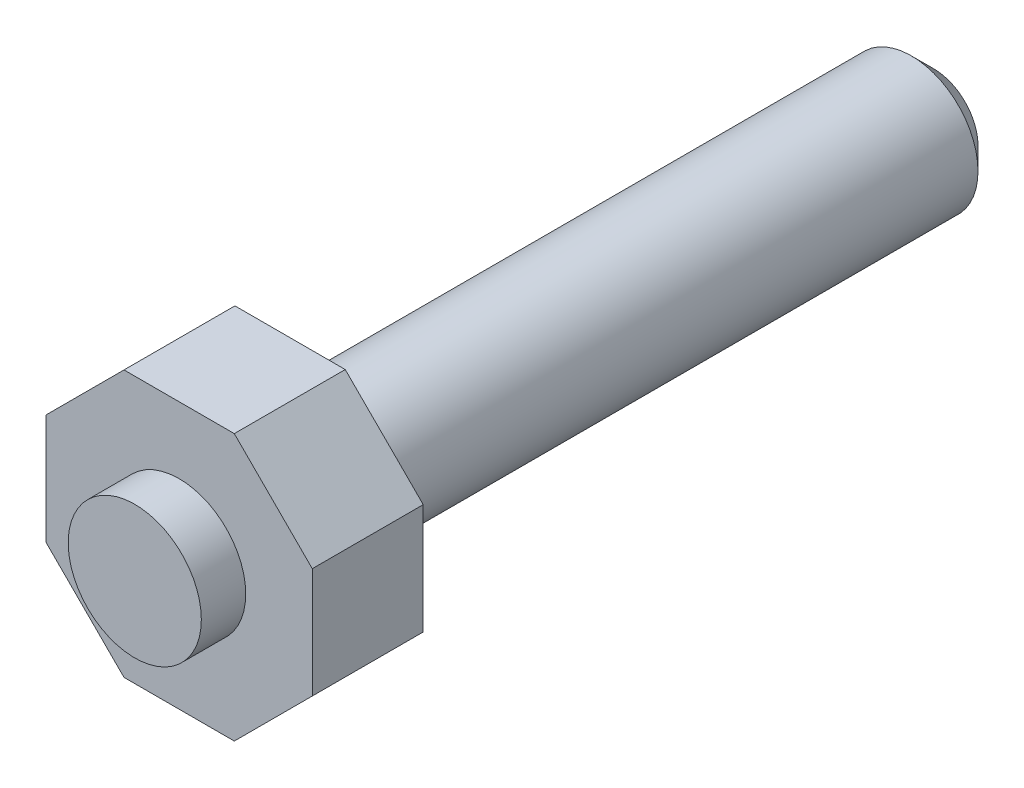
ISO-10303-21;
HEADER;
FILE_DESCRIPTION(('STEP AP214'),'2;1');
FILE_NAME('part.step','',(''),(''),'','','');
FILE_SCHEMA(('AUTOMOTIVE_DESIGN { 1 0 10303 214 1 1 1 1 }'));
ENDSEC;
DATA;
#1=APPLICATION_CONTEXT('core data for automotive mechanical design processes');
#2=APPLICATION_PROTOCOL_DEFINITION('international standard','automotive_design',2000,#1);
#3=PRODUCT_CONTEXT('',#1,'mechanical');
#4=PRODUCT('Part','Part','',(#3));
#5=PRODUCT_RELATED_PRODUCT_CATEGORY('part','',(#4));
#6=PRODUCT_DEFINITION_FORMATION('','',#4);
#7=PRODUCT_DEFINITION_CONTEXT('part definition',#1,'design');
#8=PRODUCT_DEFINITION('design','',#6,#7);
#9=PRODUCT_DEFINITION_SHAPE('','',#8);
#10=(LENGTH_UNIT() NAMED_UNIT(*) SI_UNIT(.MILLI.,.METRE.));
#11=(NAMED_UNIT(*) PLANE_ANGLE_UNIT() SI_UNIT($,.RADIAN.));
#12=(NAMED_UNIT(*) SI_UNIT($,.STERADIAN.) SOLID_ANGLE_UNIT());
#13=UNCERTAINTY_MEASURE_WITH_UNIT(LENGTH_MEASURE(1.E-05),#10,'distance_accuracy_value','');
#14=(GEOMETRIC_REPRESENTATION_CONTEXT(3) GLOBAL_UNCERTAINTY_ASSIGNED_CONTEXT((#13)) GLOBAL_UNIT_ASSIGNED_CONTEXT((#10,
#11,#12)) REPRESENTATION_CONTEXT('',''));
#15=CARTESIAN_POINT('',(0.,0.,0.));
#16=DIRECTION('',(0.,0.,1.));
#17=DIRECTION('',(1.,0.,0.));
#18=AXIS2_PLACEMENT_3D('',#15,#16,#17);
#19=CARTESIAN_POINT('',(6.,0.,58.));
#20=DIRECTION('',(0.,0.,1.));
#21=DIRECTION('',(1.,0.,0.));
#22=AXIS2_PLACEMENT_3D('',#19,#20,#21);
#23=PLANE('',#22);
#24=CARTESIAN_POINT('',(0.,0.,58.));
#25=DIRECTION('',(0.,0.,1.));
#26=DIRECTION('',(1.,0.,0.));
#27=AXIS2_PLACEMENT_3D('',#24,#25,#26);
#28=CIRCLE('',#27,6.);
#29=CARTESIAN_POINT('',(6.,0.,58.));
#30=VERTEX_POINT('',#29);
#31=EDGE_CURVE('E152',#30,#30,#28,.T.);
#32=ORIENTED_EDGE('',*,*,#31,.T.);
#33=EDGE_LOOP('',(#32));
#34=FACE_BOUND('',#33,.T.);
#35=DIRECTION('',(-0.707106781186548,-0.707106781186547,0.));
#36=VECTOR('',#35,1.);
#37=CARTESIAN_POINT('',(12.,-4.97056274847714,58.));
#38=LINE('',#37,#36);
#39=CARTESIAN_POINT('',(12.,-4.97056274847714,58.));
#40=VERTEX_POINT('',#39);
#41=CARTESIAN_POINT('',(4.97056274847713,-12.,58.));
#42=VERTEX_POINT('',#41);
#43=EDGE_CURVE('E91',#40,#42,#38,.T.);
#44=ORIENTED_EDGE('',*,*,#43,.T.);
#45=DIRECTION('',(1.,0.,0.));
#46=VECTOR('',#45,1.);
#47=CARTESIAN_POINT('',(-4.97056274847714,-12.,58.));
#48=LINE('',#47,#46);
#49=CARTESIAN_POINT('',(-4.97056274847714,-12.,58.));
#50=VERTEX_POINT('',#49);
#51=EDGE_CURVE('E97',#50,#42,#48,.T.);
#52=ORIENTED_EDGE('',*,*,#51,.F.);
#53=DIRECTION('',(0.707106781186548,-0.707106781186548,0.));
#54=VECTOR('',#53,1.);
#55=CARTESIAN_POINT('',(-12.,-4.97056274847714,58.));
#56=LINE('',#55,#54);
#57=CARTESIAN_POINT('',(-12.,-4.97056274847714,58.));
#58=VERTEX_POINT('',#57);
#59=EDGE_CURVE('E29',#58,#50,#56,.T.);
#60=ORIENTED_EDGE('',*,*,#59,.F.);
#61=DIRECTION('',(0.,-1.,0.));
#62=VECTOR('',#61,1.);
#63=CARTESIAN_POINT('',(-12.,4.97056274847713,58.));
#64=LINE('',#63,#62);
#65=CARTESIAN_POINT('',(-12.,4.97056274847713,58.));
#66=VERTEX_POINT('',#65);
#67=EDGE_CURVE('E111',#66,#58,#64,.T.);
#68=ORIENTED_EDGE('',*,*,#67,.F.);
#69=DIRECTION('',(0.707106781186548,0.707106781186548,0.));
#70=VECTOR('',#69,1.);
#71=CARTESIAN_POINT('',(-12.,4.97056274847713,58.));
#72=LINE('',#71,#70);
#73=CARTESIAN_POINT('',(-4.97056274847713,12.,58.));
#74=VERTEX_POINT('',#73);
#75=EDGE_CURVE('E108',#66,#74,#72,.T.);
#76=ORIENTED_EDGE('',*,*,#75,.T.);
#77=DIRECTION('',(1.,0.,0.));
#78=VECTOR('',#77,1.);
#79=CARTESIAN_POINT('',(-4.97056274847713,12.,58.));
#80=LINE('',#79,#78);
#81=CARTESIAN_POINT('',(4.97056274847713,12.,58.));
#82=VERTEX_POINT('',#81);
#83=EDGE_CURVE('E103',#74,#82,#80,.T.);
#84=ORIENTED_EDGE('',*,*,#83,.T.);
#85=DIRECTION('',(0.707106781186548,-0.707106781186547,0.));
#86=VECTOR('',#85,1.);
#87=CARTESIAN_POINT('',(4.97056274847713,12.,58.));
#88=LINE('',#87,#86);
#89=CARTESIAN_POINT('',(12.,4.97056274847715,58.));
#90=VERTEX_POINT('',#89);
#91=EDGE_CURVE('E101',#82,#90,#88,.T.);
#92=ORIENTED_EDGE('',*,*,#91,.T.);
#93=DIRECTION('',(0.,-1.,0.));
#94=VECTOR('',#93,1.);
#95=CARTESIAN_POINT('',(12.,4.97056274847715,58.));
#96=LINE('',#95,#94);
#97=EDGE_CURVE('E83',#90,#40,#96,.T.);
#98=ORIENTED_EDGE('',*,*,#97,.T.);
#99=EDGE_LOOP('',(#44,#52,#60,#68,#76,#84,#92,#98));
#100=FACE_BOUND('',#99,.T.);
#101=ADVANCED_FACE('F14',(#34,#100),#23,.F.);
#102=CARTESIAN_POINT('',(0.,0.,0.));
#103=DIRECTION('',(0.,0.,1.));
#104=DIRECTION('',(1.,0.,0.));
#105=AXIS2_PLACEMENT_3D('',#102,#103,#104);
#106=PLANE('',#105);
#107=CARTESIAN_POINT('',(0.,0.,0.));
#108=DIRECTION('',(0.,0.,1.));
#109=DIRECTION('',(1.,0.,0.));
#110=AXIS2_PLACEMENT_3D('',#107,#108,#109);
#111=CIRCLE('',#110,4.);
#112=CARTESIAN_POINT('',(4.,0.,0.));
#113=VERTEX_POINT('',#112);
#114=EDGE_CURVE('E9',#113,#113,#111,.F.);
#115=ORIENTED_EDGE('',*,*,#114,.T.);
#116=EDGE_LOOP('',(#115));
#117=FACE_BOUND('',#116,.T.);
#118=ADVANCED_FACE('F173',(#117),#106,.F.);
#119=CARTESIAN_POINT('',(0.,0.,80.));
#120=DIRECTION('',(0.,0.,1.));
#121=DIRECTION('',(1.,0.,0.));
#122=AXIS2_PLACEMENT_3D('',#119,#120,#121);
#123=CYLINDRICAL_SURFACE('',#122,6.);
#124=CARTESIAN_POINT('',(0.,0.,2.));
#125=DIRECTION('',(0.,0.,1.));
#126=DIRECTION('',(1.,0.,0.));
#127=AXIS2_PLACEMENT_3D('',#124,#125,#126);
#128=CIRCLE('',#127,6.);
#129=CARTESIAN_POINT('',(6.,0.,2.));
#130=VERTEX_POINT('',#129);
#131=EDGE_CURVE('E22',#130,#130,#128,.T.);
#132=ORIENTED_EDGE('',*,*,#131,.T.);
#133=EDGE_LOOP('',(#132));
#134=FACE_BOUND('',#133,.T.);
#135=ORIENTED_EDGE('',*,*,#31,.F.);
#136=EDGE_LOOP('',(#135));
#137=FACE_BOUND('',#136,.T.);
#138=ADVANCED_FACE('F157',(#134,#137),#123,.T.);
#139=CARTESIAN_POINT('',(12.,-4.97056274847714,68.));
#140=DIRECTION('',(0.707106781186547,-0.707106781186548,0.));
#141=DIRECTION('',(0.707106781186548,0.707106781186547,0.));
#142=AXIS2_PLACEMENT_3D('',#139,#140,#141);
#143=PLANE('',#142);
#144=DIRECTION('',(0.,0.,-1.));
#145=VECTOR('',#144,1.);
#146=CARTESIAN_POINT('',(12.,-4.97056274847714,68.));
#147=LINE('',#146,#145);
#148=CARTESIAN_POINT('',(12.,-4.97056274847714,68.));
#149=VERTEX_POINT('',#148);
#150=EDGE_CURVE('E79',#149,#40,#147,.T.);
#151=ORIENTED_EDGE('',*,*,#150,.F.);
#152=DIRECTION('',(-0.707106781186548,-0.707106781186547,0.));
#153=VECTOR('',#152,1.);
#154=CARTESIAN_POINT('',(12.,-4.97056274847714,68.));
#155=LINE('',#154,#153);
#156=CARTESIAN_POINT('',(4.97056274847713,-12.,68.));
#157=VERTEX_POINT('',#156);
#158=EDGE_CURVE('E37',#149,#157,#155,.T.);
#159=ORIENTED_EDGE('',*,*,#158,.T.);
#160=DIRECTION('',(0.,0.,-1.));
#161=VECTOR('',#160,1.);
#162=CARTESIAN_POINT('',(4.97056274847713,-12.,68.));
#163=LINE('',#162,#161);
#164=EDGE_CURVE('E93',#157,#42,#163,.T.);
#165=ORIENTED_EDGE('',*,*,#164,.T.);
#166=ORIENTED_EDGE('',*,*,#43,.F.);
#167=EDGE_LOOP('',(#151,#159,#165,#166));
#168=FACE_BOUND('',#167,.T.);
#169=ADVANCED_FACE('F92',(#168),#143,.T.);
#170=CARTESIAN_POINT('',(12.,4.97056274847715,68.));
#171=DIRECTION('',(1.,0.,0.));
#172=DIRECTION('',(0.,0.,-1.));
#173=AXIS2_PLACEMENT_3D('',#170,#171,#172);
#174=PLANE('',#173);
#175=DIRECTION('',(0.,0.,-1.));
#176=VECTOR('',#175,1.);
#177=CARTESIAN_POINT('',(12.,4.97056274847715,68.));
#178=LINE('',#177,#176);
#179=CARTESIAN_POINT('',(12.,4.97056274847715,68.));
#180=VERTEX_POINT('',#179);
#181=EDGE_CURVE('E88',#180,#90,#178,.T.);
#182=ORIENTED_EDGE('',*,*,#181,.F.);
#183=DIRECTION('',(0.,-1.,0.));
#184=VECTOR('',#183,1.);
#185=CARTESIAN_POINT('',(12.,4.97056274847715,68.));
#186=LINE('',#185,#184);
#187=EDGE_CURVE('E86',#180,#149,#186,.T.);
#188=ORIENTED_EDGE('',*,*,#187,.T.);
#189=ORIENTED_EDGE('',*,*,#150,.T.);
#190=ORIENTED_EDGE('',*,*,#97,.F.);
#191=EDGE_LOOP('',(#182,#188,#189,#190));
#192=FACE_BOUND('',#191,.T.);
#193=ADVANCED_FACE('F81',(#192),#174,.T.);
#194=CARTESIAN_POINT('',(4.97056274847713,12.,68.));
#195=DIRECTION('',(0.707106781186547,0.707106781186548,0.));
#196=DIRECTION('',(-0.707106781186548,0.707106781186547,0.));
#197=AXIS2_PLACEMENT_3D('',#194,#195,#196);
#198=PLANE('',#197);
#199=DIRECTION('',(0.,0.,-1.));
#200=VECTOR('',#199,1.);
#201=CARTESIAN_POINT('',(4.97056274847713,12.,68.));
#202=LINE('',#201,#200);
#203=CARTESIAN_POINT('',(4.97056274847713,12.,68.));
#204=VERTEX_POINT('',#203);
#205=EDGE_CURVE('E144',#204,#82,#202,.T.);
#206=ORIENTED_EDGE('',*,*,#205,.F.);
#207=DIRECTION('',(0.707106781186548,-0.707106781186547,0.));
#208=VECTOR('',#207,1.);
#209=CARTESIAN_POINT('',(4.97056274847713,12.,68.));
#210=LINE('',#209,#208);
#211=EDGE_CURVE('E124',#204,#180,#210,.T.);
#212=ORIENTED_EDGE('',*,*,#211,.T.);
#213=ORIENTED_EDGE('',*,*,#181,.T.);
#214=ORIENTED_EDGE('',*,*,#91,.F.);
#215=EDGE_LOOP('',(#206,#212,#213,#214));
#216=FACE_BOUND('',#215,.T.);
#217=ADVANCED_FACE('F193',(#216),#198,.T.);
#218=CARTESIAN_POINT('',(-4.97056274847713,12.,68.));
#219=DIRECTION('',(0.,1.,0.));
#220=DIRECTION('',(0.,0.,1.));
#221=AXIS2_PLACEMENT_3D('',#218,#219,#220);
#222=PLANE('',#221);
#223=DIRECTION('',(0.,0.,-1.));
#224=VECTOR('',#223,1.);
#225=CARTESIAN_POINT('',(-4.97056274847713,12.,68.));
#226=LINE('',#225,#224);
#227=CARTESIAN_POINT('',(-4.97056274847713,12.,68.));
#228=VERTEX_POINT('',#227);
#229=EDGE_CURVE('E142',#228,#74,#226,.T.);
#230=ORIENTED_EDGE('',*,*,#229,.F.);
#231=DIRECTION('',(1.,0.,0.));
#232=VECTOR('',#231,1.);
#233=CARTESIAN_POINT('',(-4.97056274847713,12.,68.));
#234=LINE('',#233,#232);
#235=EDGE_CURVE('E128',#228,#204,#234,.T.);
#236=ORIENTED_EDGE('',*,*,#235,.T.);
#237=ORIENTED_EDGE('',*,*,#205,.T.);
#238=ORIENTED_EDGE('',*,*,#83,.F.);
#239=EDGE_LOOP('',(#230,#236,#237,#238));
#240=FACE_BOUND('',#239,.T.);
#241=ADVANCED_FACE('F211',(#240),#222,.T.);
#242=CARTESIAN_POINT('',(-12.,4.97056274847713,68.));
#243=DIRECTION('',(-0.707106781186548,0.707106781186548,0.));
#244=DIRECTION('',(-0.707106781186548,-0.707106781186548,0.));
#245=AXIS2_PLACEMENT_3D('',#242,#243,#244);
#246=PLANE('',#245);
#247=DIRECTION('',(0.,0.,-1.));
#248=VECTOR('',#247,1.);
#249=CARTESIAN_POINT('',(-12.,4.97056274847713,68.));
#250=LINE('',#249,#248);
#251=CARTESIAN_POINT('',(-12.,4.97056274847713,68.));
#252=VERTEX_POINT('',#251);
#253=EDGE_CURVE('E140',#252,#66,#250,.T.);
#254=ORIENTED_EDGE('',*,*,#253,.F.);
#255=DIRECTION('',(0.707106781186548,0.707106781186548,0.));
#256=VECTOR('',#255,1.);
#257=CARTESIAN_POINT('',(-12.,4.97056274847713,68.));
#258=LINE('',#257,#256);
#259=EDGE_CURVE('E125',#252,#228,#258,.T.);
#260=ORIENTED_EDGE('',*,*,#259,.T.);
#261=ORIENTED_EDGE('',*,*,#229,.T.);
#262=ORIENTED_EDGE('',*,*,#75,.F.);
#263=EDGE_LOOP('',(#254,#260,#261,#262));
#264=FACE_BOUND('',#263,.T.);
#265=ADVANCED_FACE('F207',(#264),#246,.T.);
#266=CARTESIAN_POINT('',(-12.,4.97056274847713,68.));
#267=DIRECTION('',(1.,0.,0.));
#268=DIRECTION('',(0.,1.,0.));
#269=AXIS2_PLACEMENT_3D('',#266,#267,#268);
#270=PLANE('',#269);
#271=DIRECTION('',(0.,0.,-1.));
#272=VECTOR('',#271,1.);
#273=CARTESIAN_POINT('',(-12.,-4.97056274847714,68.));
#274=LINE('',#273,#272);
#275=CARTESIAN_POINT('',(-12.,-4.97056274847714,68.));
#276=VERTEX_POINT('',#275);
#277=EDGE_CURVE('E138',#276,#58,#274,.T.);
#278=ORIENTED_EDGE('',*,*,#277,.F.);
#279=DIRECTION('',(0.,-1.,0.));
#280=VECTOR('',#279,1.);
#281=CARTESIAN_POINT('',(-12.,4.97056274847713,68.));
#282=LINE('',#281,#280);
#283=EDGE_CURVE('E122',#252,#276,#282,.T.);
#284=ORIENTED_EDGE('',*,*,#283,.F.);
#285=ORIENTED_EDGE('',*,*,#253,.T.);
#286=ORIENTED_EDGE('',*,*,#67,.T.);
#287=EDGE_LOOP('',(#278,#284,#285,#286));
#288=FACE_BOUND('',#287,.T.);
#289=ADVANCED_FACE('F204',(#288),#270,.F.);
#290=CARTESIAN_POINT('',(-12.,-4.97056274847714,68.));
#291=DIRECTION('',(0.707106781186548,0.707106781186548,0.));
#292=DIRECTION('',(-0.707106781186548,0.707106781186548,0.));
#293=AXIS2_PLACEMENT_3D('',#290,#291,#292);
#294=PLANE('',#293);
#295=DIRECTION('',(0.,0.,-1.));
#296=VECTOR('',#295,1.);
#297=CARTESIAN_POINT('',(-4.97056274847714,-12.,68.));
#298=LINE('',#297,#296);
#299=CARTESIAN_POINT('',(-4.97056274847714,-12.,68.));
#300=VERTEX_POINT('',#299);
#301=EDGE_CURVE('E136',#300,#50,#298,.T.);
#302=ORIENTED_EDGE('',*,*,#301,.F.);
#303=DIRECTION('',(0.707106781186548,-0.707106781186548,0.));
#304=VECTOR('',#303,1.);
#305=CARTESIAN_POINT('',(-12.,-4.97056274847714,68.));
#306=LINE('',#305,#304);
#307=EDGE_CURVE('E119',#276,#300,#306,.T.);
#308=ORIENTED_EDGE('',*,*,#307,.F.);
#309=ORIENTED_EDGE('',*,*,#277,.T.);
#310=ORIENTED_EDGE('',*,*,#59,.T.);
#311=EDGE_LOOP('',(#302,#308,#309,#310));
#312=FACE_BOUND('',#311,.T.);
#313=ADVANCED_FACE('F200',(#312),#294,.F.);
#314=CARTESIAN_POINT('',(-4.97056274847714,-12.,68.));
#315=DIRECTION('',(0.,1.,0.));
#316=DIRECTION('',(0.,0.,1.));
#317=AXIS2_PLACEMENT_3D('',#314,#315,#316);
#318=PLANE('',#317);
#319=DIRECTION('',(1.,0.,0.));
#320=VECTOR('',#319,1.);
#321=CARTESIAN_POINT('',(-4.97056274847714,-12.,68.));
#322=LINE('',#321,#320);
#323=EDGE_CURVE('E116',#300,#157,#322,.T.);
#324=ORIENTED_EDGE('',*,*,#323,.F.);
#325=ORIENTED_EDGE('',*,*,#301,.T.);
#326=ORIENTED_EDGE('',*,*,#51,.T.);
#327=ORIENTED_EDGE('',*,*,#164,.F.);
#328=EDGE_LOOP('',(#324,#325,#326,#327));
#329=FACE_BOUND('',#328,.T.);
#330=ADVANCED_FACE('F196',(#329),#318,.F.);
#331=CARTESIAN_POINT('',(6.,0.,72.));
#332=DIRECTION('',(0.,0.,-1.));
#333=DIRECTION('',(-1.,0.,0.));
#334=AXIS2_PLACEMENT_3D('',#331,#332,#333);
#335=PLANE('',#334);
#336=CARTESIAN_POINT('',(0.,0.,72.));
#337=DIRECTION('',(0.,0.,1.));
#338=DIRECTION('',(1.,0.,0.));
#339=AXIS2_PLACEMENT_3D('',#336,#337,#338);
#340=CIRCLE('',#339,6.);
#341=CARTESIAN_POINT('',(6.,0.,72.));
#342=VERTEX_POINT('',#341);
#343=EDGE_CURVE('E87',#342,#342,#340,.T.);
#344=ORIENTED_EDGE('',*,*,#343,.T.);
#345=EDGE_LOOP('',(#344));
#346=FACE_BOUND('',#345,.T.);
#347=ADVANCED_FACE('F199',(#346),#335,.F.);
#348=CARTESIAN_POINT('',(0.,0.,80.));
#349=DIRECTION('',(0.,0.,1.));
#350=DIRECTION('',(1.,0.,0.));
#351=AXIS2_PLACEMENT_3D('',#348,#349,#350);
#352=CYLINDRICAL_SURFACE('',#351,6.);
#353=ORIENTED_EDGE('',*,*,#343,.F.);
#354=EDGE_LOOP('',(#353));
#355=FACE_BOUND('',#354,.T.);
#356=CARTESIAN_POINT('',(0.,0.,68.));
#357=DIRECTION('',(0.,0.,1.));
#358=DIRECTION('',(1.,0.,0.));
#359=AXIS2_PLACEMENT_3D('',#356,#357,#358);
#360=CIRCLE('',#359,6.);
#361=CARTESIAN_POINT('',(6.,0.,68.));
#362=VERTEX_POINT('',#361);
#363=EDGE_CURVE('E149',#362,#362,#360,.T.);
#364=ORIENTED_EDGE('',*,*,#363,.T.);
#365=EDGE_LOOP('',(#364));
#366=FACE_BOUND('',#365,.T.);
#367=ADVANCED_FACE('F168',(#355,#366),#352,.T.);
#368=CARTESIAN_POINT('',(14.,0.,68.));
#369=DIRECTION('',(0.,0.,-1.));
#370=DIRECTION('',(-1.,0.,0.));
#371=AXIS2_PLACEMENT_3D('',#368,#369,#370);
#372=PLANE('',#371);
#373=ORIENTED_EDGE('',*,*,#363,.F.);
#374=EDGE_LOOP('',(#373));
#375=FACE_BOUND('',#374,.T.);
#376=ORIENTED_EDGE('',*,*,#158,.F.);
#377=ORIENTED_EDGE('',*,*,#187,.F.);
#378=ORIENTED_EDGE('',*,*,#211,.F.);
#379=ORIENTED_EDGE('',*,*,#235,.F.);
#380=ORIENTED_EDGE('',*,*,#259,.F.);
#381=ORIENTED_EDGE('',*,*,#283,.T.);
#382=ORIENTED_EDGE('',*,*,#307,.T.);
#383=ORIENTED_EDGE('',*,*,#323,.T.);
#384=EDGE_LOOP('',(#376,#377,#378,#379,#380,#381,#382,#383));
#385=FACE_BOUND('',#384,.T.);
#386=ADVANCED_FACE('F161',(#375,#385),#372,.F.);
#387=CARTESIAN_POINT('',(0.,0.,2.));
#388=DIRECTION('',(0.,0.,1.));
#389=DIRECTION('',(1.,0.,0.));
#390=AXIS2_PLACEMENT_3D('',#387,#388,#389);
#391=CONICAL_SURFACE('',#390,6.,0.78539816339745);
#392=ORIENTED_EDGE('',*,*,#114,.F.);
#393=EDGE_LOOP('',(#392));
#394=FACE_BOUND('',#393,.T.);
#395=ORIENTED_EDGE('',*,*,#131,.F.);
#396=EDGE_LOOP('',(#395));
#397=FACE_BOUND('',#396,.T.);
#398=ADVANCED_FACE('F16',(#394,#397),#391,.T.);
#399=CLOSED_SHELL('',(#101,#118,#138,#169,#193,#217,#241,#265,#289,#313,#330,#347,#367,#386,#398));
#400=MANIFOLD_SOLID_BREP('B1',#399);
#401=ADVANCED_BREP_SHAPE_REPRESENTATION('',(#18,#400),#14);
#402=SHAPE_DEFINITION_REPRESENTATION(#9,#401);
ENDSEC;
END-ISO-10303-21;
